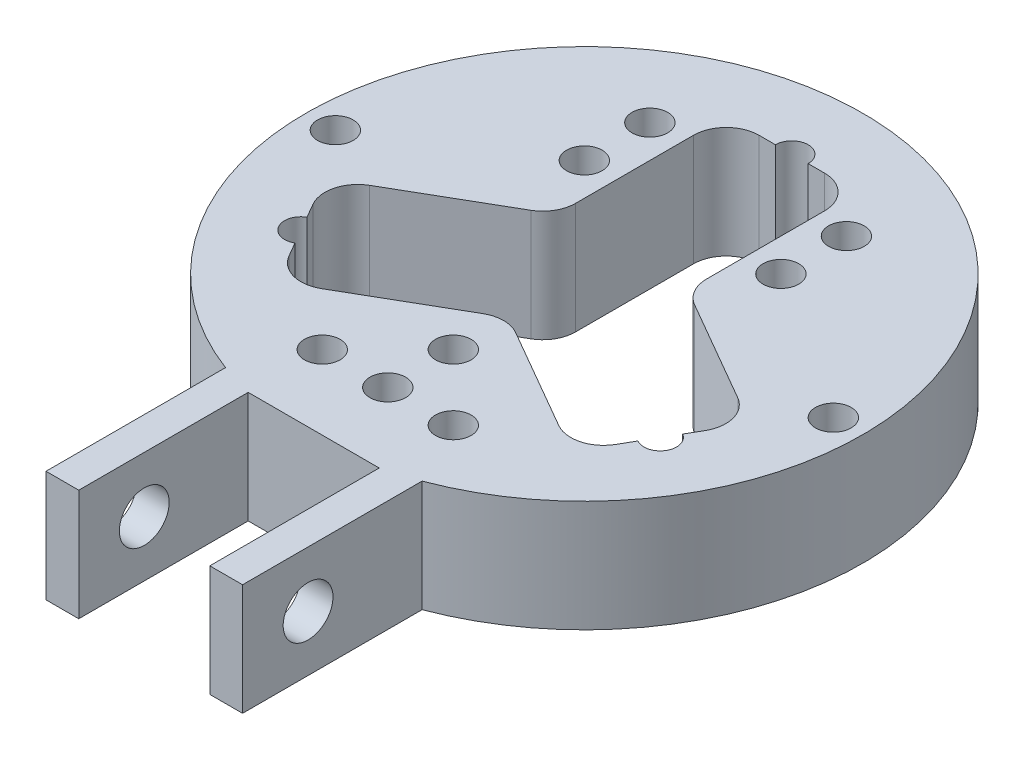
from build123d import *

# Parameters (mm, degrees)
BOSS_EXTRUDE1_DEPTH       = 10.795
F_5_CLEARANCE_HOLE1_D     = 3.4544
F_5_CLEARANCE_HOLE1_DEPTH = 19.05
F_5_CLEARANCE_HOLE1_TIP   = 1.037806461
SKETCH6_R                 = 2.413
CUT_EXTRUDE1_DEPTH        = 58.172497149


with BuildPart() as part:
    # Sketch1 → Boss-Extrude1 (new body)
    with BuildSketch(Plane(origin=(0, 0, 0), x_dir=(1, 0, 0), z_dir=(0, 1, 0))):
        with BuildLine():
            Line((-6.35, -26.229804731), (6.35, -26.229804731))
            Line((6.35, -26.229804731), (6.35, -42.649733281))
            Line((6.35, -42.649733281), (9.525, -42.649733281))
            Line((9.525, -42.649733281), (9.525, -25.250733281))
            ThreePointArc((9.525, -25.250733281), (0, 26.9875), (-9.525, -25.250733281))
            Line((-9.525, -25.250733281), (-9.525, -42.649733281))
            Line((-9.525, -42.649733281), (-6.35, -42.649733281))
            Line((-6.35, -42.649733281), (-6.35, -26.229804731))
        make_face()
        with BuildLine():
            Line((-3.175, 20.104261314), (-1.5875, 20.104261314))
            ThreePointArc((-1.5875, 20.104261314), (0, 21.691761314), (1.5875, 20.104261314))
            Line((1.5875, 20.104261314), (3.175, 20.104261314))
            ThreePointArc((3.175, 20.104261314), (5.42006403, 19.174325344), (6.35, 16.929261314))
            Line((6.35, 16.929261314), (6.35, 5.499261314))
            ThreePointArc((6.35, 5.499261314), (6.775369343, 3.911761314), (7.9375, 2.749630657))
            Line((7.9375, 2.749630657), (17.836170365, -2.965369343))
            ThreePointArc((17.836170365, -2.965369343), (19.315484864, -4.893249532), (18.998301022, -7.3025))
            Line((18.998301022, -7.3025), (18.204551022, -8.677315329))
            ThreePointArc((18.204551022, -8.677315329), (18.785616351, -10.845880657), (16.617051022, -11.426945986))
            Line((16.617051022, -11.426945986), (15.823301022, -12.801761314))
            ThreePointArc((15.823301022, -12.801761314), (13.895420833, -14.281075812), (11.486170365, -13.963891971))
            Line((11.486170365, -13.963891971), (1.5875, -8.248891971))
            ThreePointArc((1.5875, -8.248891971), (0, -7.823522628), (-1.5875, -8.248891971))
            Line((-1.5875, -8.248891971), (-11.486170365, -13.963891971))
            ThreePointArc((-11.486170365, -13.963891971), (-13.895420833, -14.281075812), (-15.823301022, -12.801761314))
            Line((-15.823301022, -12.801761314), (-16.617051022, -11.426945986))
            ThreePointArc((-16.617051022, -11.426945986), (-18.785616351, -10.845880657), (-18.204551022, -8.677315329))
            Line((-18.204551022, -8.677315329), (-18.998301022, -7.3025))
            ThreePointArc((-18.998301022, -7.3025), (-19.315484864, -4.893249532), (-17.836170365, -2.965369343))
            Line((-17.836170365, -2.965369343), (-7.9375, 2.749630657))
            ThreePointArc((-7.9375, 2.749630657), (-6.775369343, 3.911761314), (-6.35, 5.499261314))
            Line((-6.35, 5.499261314), (-6.35, 16.929261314))
            ThreePointArc((-6.35, 16.929261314), (-5.42006403, 19.174325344), (-3.175, 20.104261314))
        make_face(mode=Mode.SUBTRACT)
    extrude(amount=BOSS_EXTRUDE1_DEPTH)

    # 5 Clearance Hole1
    with Locations(Plane(origin=(-9.525, 10.795, -9.525), x_dir=(0, 0, 1), z_dir=(0, 1, 0))):
        with Locations((0, 0), (0, 19.05), (28.575, 9.525), (-6.35, 0), (-6.35, 19.05), (9.525, 33.655), (9.525, -14.605), (28.575, 3.175), (22.225, 9.525), (28.575, 15.875)):
            Hole(F_5_CLEARANCE_HOLE1_D / 2, depth=F_5_CLEARANCE_HOLE1_DEPTH)
            with Locations((0, 0, -(F_5_CLEARANCE_HOLE1_DEPTH + F_5_CLEARANCE_HOLE1_TIP / 2))):  # 118° drill point
                Cone(0, F_5_CLEARANCE_HOLE1_D / 2, F_5_CLEARANCE_HOLE1_TIP, mode=Mode.SUBTRACT)

    # Sketch6 → Cut-Extrude1 (cut, through all)
    with BuildSketch(Plane(origin=(9.525, 0, 0), x_dir=(0, 0, -1), z_dir=(1, 0, 0))):
        with Locations((-36.299733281, 5.3975)):
            Circle(SKETCH6_R)
    extrude(amount=-CUT_EXTRUDE1_DEPTH, mode=Mode.SUBTRACT)


solid = part.part
